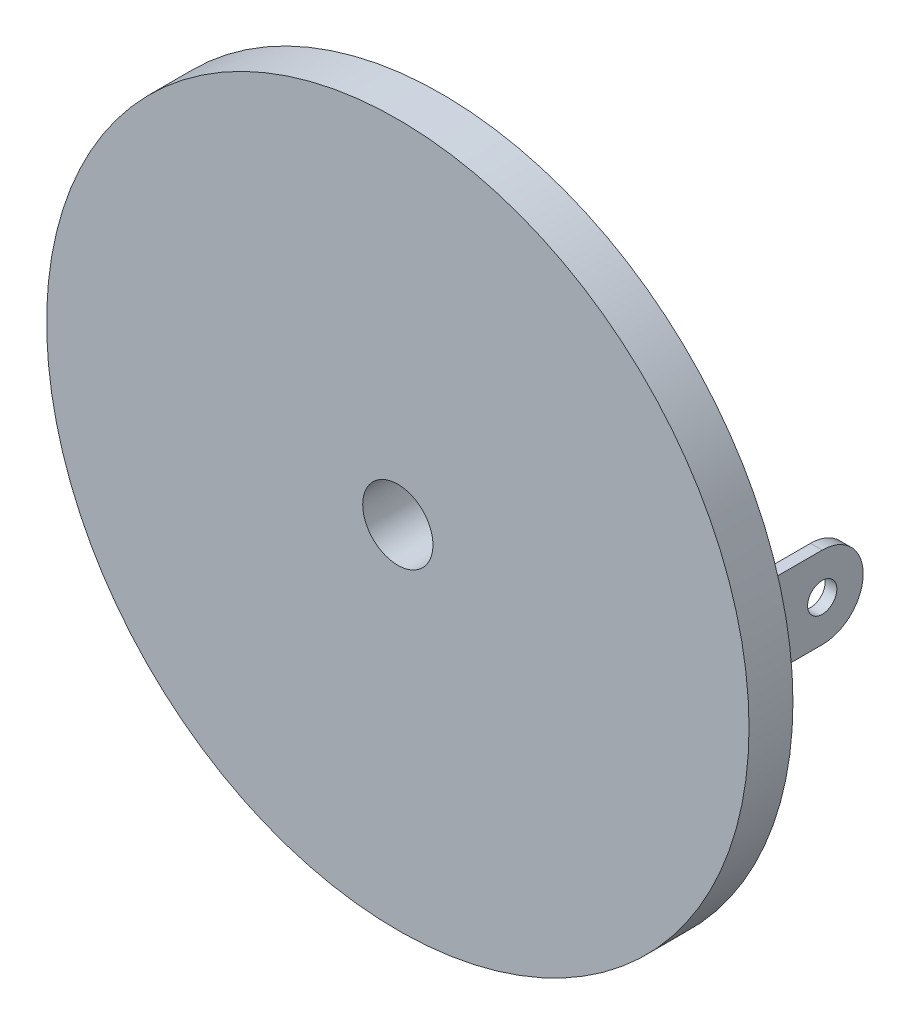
from build123d import *

# Parameters (mm, degrees)
ESQUISSE1_R             = 12
EXTRUSION1_DEPTH        = 1.5
ESQUISSE2_W             = 0.4
ESQUISSE2_H             = 2.8
EXTRUSION2_DEPTH        = 5
ESQUISSE3_R             = 4.2
EXTRUSION3_DEPTH        = 2
ESQUISSE4_R             = 0.5
ENL_V_MAT_EXTRU_1_DEPTH = 26.039169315
ESQUISSE5_R             = 1.2
ENL_V_MAT_EXTRU_2_DEPTH = 18.327723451


with BuildPart() as part:
    # Esquisse1 → Extrusion1 (new body)
    with BuildSketch(Plane.XY):
        Circle(ESQUISSE1_R)
    extrude(amount=EXTRUSION1_DEPTH)

    # Esquisse2 → Extrusion2 (add)
    with BuildSketch(Plane(origin=(0, 0, 0), x_dir=(-1, 0, 0), z_dir=(0, 0, -1))):
        with Locations((9.2, 0)):
            Rectangle(ESQUISSE2_W, ESQUISSE2_H)
        with Locations((-9.2, 0)):
            Rectangle(ESQUISSE2_W, ESQUISSE2_H)
    extrude(amount=EXTRUSION2_DEPTH)

    # Esquisse3 → Extrusion3 (add)
    with BuildSketch(Plane(origin=(0, 0, 0), x_dir=(-1, 0, 0), z_dir=(0, 0, -1))):
        with Locations(Location((0, 0, 0), (0, 0, 180))):
            Circle(ESQUISSE3_R)
    extrude(amount=EXTRUSION3_DEPTH)

    # Esquisse4 → Enl_v. mat.-Extru.1 (cut, through all)
    with BuildSketch(Plane(origin=(9.4, 0, 0), x_dir=(0, 0, -1), z_dir=(1, 0, 0))):
        with Locations((3.6, 0)):
            Circle(ESQUISSE4_R)
        with BuildLine():
            Line((3.6, 1.4), (3.6, 1.511382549))
            Line((3.6, 1.511382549), (5.122212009, 1.511382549))
            Line((5.122212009, 1.511382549), (5.122212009, -1.492036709))
            Line((5.122212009, -1.492036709), (3.6, -1.492036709))
            Line((3.6, -1.492036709), (3.6, -1.4))
            ThreePointArc((3.6, -1.4), (5, 0), (3.6, 1.4))
        make_face()
    extrude(amount=-ENL_V_MAT_EXTRU_1_DEPTH, mode=Mode.SUBTRACT)

    # Esquisse5 → Enl_v. mat.-Extru.2 (cut, through all)
    with BuildSketch(Plane(origin=(0, 0, -2), x_dir=(-1, 0, 0), z_dir=(0, 0, -1))):
        Circle(ESQUISSE5_R)
    extrude(amount=-ENL_V_MAT_EXTRU_2_DEPTH, mode=Mode.SUBTRACT)


solid = part.part
